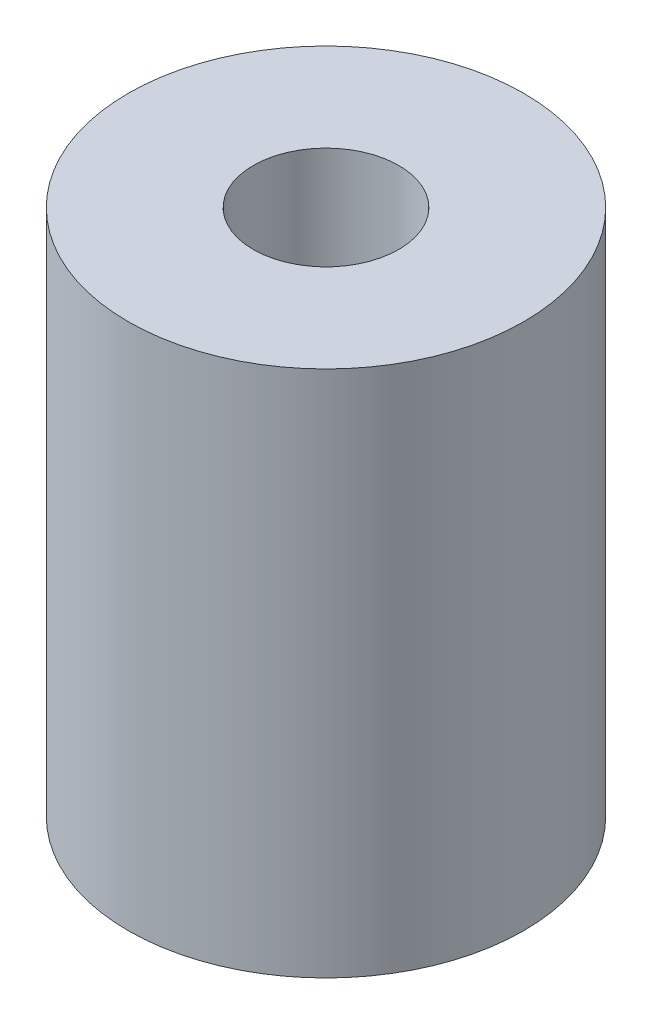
from build123d import *

# Parameters (mm, degrees)
SKETCH1_R             = 4.7625
EXTRUDE1_DEPTH        = 12.7
F_6_32_TAPPED_HOLE1_D = 3.5052


with BuildPart() as part:
    # Sketch1 → Extrude1 (new body)
    with BuildSketch(Plane(origin=(0, 0, 0), x_dir=(1, 0, 0), z_dir=(0, 1, 0))):
        with Locations(Location((0, 0, 0), (0, 0, 270))):
            Circle(SKETCH1_R)
    extrude(amount=EXTRUDE1_DEPTH)

    # 6-32 Tapped Hole1 (through all)
    with Locations(Plane.ZX.offset(12.7)):
        with Locations((0, 0)):
            Hole(F_6_32_TAPPED_HOLE1_D / 2)


solid = part.part
